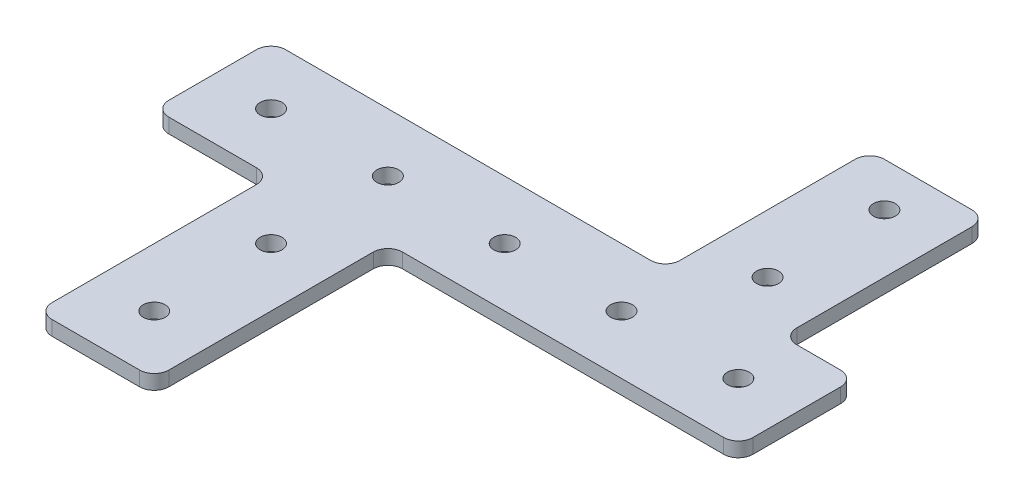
ISO-10303-21;
HEADER;
FILE_DESCRIPTION(('STEP AP214'),'2;1');
FILE_NAME('part.step','',(''),(''),'','','');
FILE_SCHEMA(('AUTOMOTIVE_DESIGN { 1 0 10303 214 1 1 1 1 }'));
ENDSEC;
DATA;
#1=APPLICATION_CONTEXT('core data for automotive mechanical design processes');
#2=APPLICATION_PROTOCOL_DEFINITION('international standard','automotive_design',2000,#1);
#3=PRODUCT_CONTEXT('',#1,'mechanical');
#4=PRODUCT('Part','Part','',(#3));
#5=PRODUCT_RELATED_PRODUCT_CATEGORY('part','',(#4));
#6=PRODUCT_DEFINITION_FORMATION('','',#4);
#7=PRODUCT_DEFINITION_CONTEXT('part definition',#1,'design');
#8=PRODUCT_DEFINITION('design','',#6,#7);
#9=PRODUCT_DEFINITION_SHAPE('','',#8);
#10=(LENGTH_UNIT() NAMED_UNIT(*) SI_UNIT(.MILLI.,.METRE.));
#11=(NAMED_UNIT(*) PLANE_ANGLE_UNIT() SI_UNIT($,.RADIAN.));
#12=(NAMED_UNIT(*) SI_UNIT($,.STERADIAN.) SOLID_ANGLE_UNIT());
#13=UNCERTAINTY_MEASURE_WITH_UNIT(LENGTH_MEASURE(1.E-05),#10,'distance_accuracy_value','');
#14=(GEOMETRIC_REPRESENTATION_CONTEXT(3) GLOBAL_UNCERTAINTY_ASSIGNED_CONTEXT((#13)) GLOBAL_UNIT_ASSIGNED_CONTEXT((#10,
#11,#12)) REPRESENTATION_CONTEXT('',''));
#15=CARTESIAN_POINT('',(0.,0.,0.));
#16=DIRECTION('',(0.,0.,1.));
#17=DIRECTION('',(1.,0.,0.));
#18=AXIS2_PLACEMENT_3D('',#15,#16,#17);
#19=CARTESIAN_POINT('',(0.,3.175,0.));
#20=DIRECTION('',(0.,1.,0.));
#21=DIRECTION('',(0.,0.,1.));
#22=AXIS2_PLACEMENT_3D('',#19,#20,#21);
#23=PLANE('',#22);
#24=CARTESIAN_POINT('',(-47.625,3.175,82.55));
#25=DIRECTION('',(0.,1.,0.));
#26=DIRECTION('',(0.,0.,1.));
#27=AXIS2_PLACEMENT_3D('',#24,#25,#26);
#28=CIRCLE('',#27,2.38125);
#29=CARTESIAN_POINT('',(-47.625,3.175,84.93125));
#30=VERTEX_POINT('',#29);
#31=EDGE_CURVE('E802',#30,#30,#28,.T.);
#32=ORIENTED_EDGE('',*,*,#31,.F.);
#33=EDGE_LOOP('',(#32));
#34=FACE_BOUND('',#33,.T.);
#35=CARTESIAN_POINT('',(-73.025,3.175,57.15));
#36=DIRECTION('',(0.,1.,0.));
#37=DIRECTION('',(0.,0.,1.));
#38=AXIS2_PLACEMENT_3D('',#35,#36,#37);
#39=CIRCLE('',#38,2.38125);
#40=CARTESIAN_POINT('',(-73.025,3.175,59.53125));
#41=VERTEX_POINT('',#40);
#42=EDGE_CURVE('E790',#41,#41,#39,.T.);
#43=ORIENTED_EDGE('',*,*,#42,.F.);
#44=EDGE_LOOP('',(#43));
#45=FACE_BOUND('',#44,.T.);
#46=CARTESIAN_POINT('',(12.7,3.175,9.52499999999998));
#47=DIRECTION('',(0.,1.,0.));
#48=DIRECTION('',(0.,0.,1.));
#49=AXIS2_PLACEMENT_3D('',#46,#47,#48);
#50=CIRCLE('',#49,2.38125);
#51=CARTESIAN_POINT('',(12.7,3.175,11.90625));
#52=VERTEX_POINT('',#51);
#53=EDGE_CURVE('E778',#52,#52,#50,.T.);
#54=ORIENTED_EDGE('',*,*,#53,.F.);
#55=EDGE_LOOP('',(#54));
#56=FACE_BOUND('',#55,.T.);
#57=CARTESIAN_POINT('',(3.175,3.175,57.15));
#58=DIRECTION('',(0.,1.,0.));
#59=DIRECTION('',(0.,0.,1.));
#60=AXIS2_PLACEMENT_3D('',#57,#58,#59);
#61=CIRCLE('',#60,2.38125);
#62=CARTESIAN_POINT('',(3.175,3.175,59.53125));
#63=VERTEX_POINT('',#62);
#64=EDGE_CURVE('E766',#63,#63,#61,.T.);
#65=ORIENTED_EDGE('',*,*,#64,.F.);
#66=EDGE_LOOP('',(#65));
#67=FACE_BOUND('',#66,.T.);
#68=DIRECTION('',(1.,0.,0.));
#69=VECTOR('',#68,1.);
#70=CARTESIAN_POINT('',(41.275,3.175,69.85));
#71=LINE('',#70,#69);
#72=CARTESIAN_POINT('',(-31.75,3.175,69.85));
#73=VERTEX_POINT('',#72);
#74=CARTESIAN_POINT('',(38.1,3.175,69.85));
#75=VERTEX_POINT('',#74);
#76=EDGE_CURVE('E217',#73,#75,#71,.T.);
#77=ORIENTED_EDGE('',*,*,#76,.T.);
#78=CARTESIAN_POINT('',(38.1,3.175,66.675));
#79=DIRECTION('',(0.,1.,0.));
#80=DIRECTION('',(0.,0.,1.));
#81=AXIS2_PLACEMENT_3D('',#78,#79,#80);
#82=CIRCLE('',#81,3.175);
#83=CARTESIAN_POINT('',(41.275,3.175,66.675));
#84=VERTEX_POINT('',#83);
#85=EDGE_CURVE('E284',#75,#84,#82,.T.);
#86=ORIENTED_EDGE('',*,*,#85,.T.);
#87=DIRECTION('',(0.,0.,-1.));
#88=VECTOR('',#87,1.);
#89=CARTESIAN_POINT('',(41.275,3.175,44.45));
#90=LINE('',#89,#88);
#91=CARTESIAN_POINT('',(41.275,3.175,47.625));
#92=VERTEX_POINT('',#91);
#93=EDGE_CURVE('E374',#84,#92,#90,.T.);
#94=ORIENTED_EDGE('',*,*,#93,.T.);
#95=CARTESIAN_POINT('',(38.1,3.175,47.625));
#96=DIRECTION('',(0.,1.,0.));
#97=DIRECTION('',(0.,0.,1.));
#98=AXIS2_PLACEMENT_3D('',#95,#96,#97);
#99=CIRCLE('',#98,3.175);
#100=CARTESIAN_POINT('',(38.1,3.175,44.45));
#101=VERTEX_POINT('',#100);
#102=EDGE_CURVE('E274',#92,#101,#99,.T.);
#103=ORIENTED_EDGE('',*,*,#102,.T.);
#104=DIRECTION('',(-1.,0.,0.));
#105=VECTOR('',#104,1.);
#106=CARTESIAN_POINT('',(25.4,3.175,44.45));
#107=LINE('',#106,#105);
#108=CARTESIAN_POINT('',(28.575,3.175,44.45));
#109=VERTEX_POINT('',#108);
#110=EDGE_CURVE('E377',#101,#109,#107,.T.);
#111=ORIENTED_EDGE('',*,*,#110,.T.);
#112=CARTESIAN_POINT('',(28.575,3.175,41.275));
#113=DIRECTION('',(0.,1.,0.));
#114=DIRECTION('',(0.,0.,1.));
#115=AXIS2_PLACEMENT_3D('',#112,#113,#114);
#116=CIRCLE('',#115,3.175);
#117=CARTESIAN_POINT('',(25.4,3.175,41.275));
#118=VERTEX_POINT('',#117);
#119=EDGE_CURVE('E336',#109,#118,#116,.F.);
#120=ORIENTED_EDGE('',*,*,#119,.T.);
#121=DIRECTION('',(0.,0.,-1.));
#122=VECTOR('',#121,1.);
#123=CARTESIAN_POINT('',(25.4,3.175,0.));
#124=LINE('',#123,#122);
#125=CARTESIAN_POINT('',(25.4,3.175,3.175));
#126=VERTEX_POINT('',#125);
#127=EDGE_CURVE('E380',#118,#126,#124,.T.);
#128=ORIENTED_EDGE('',*,*,#127,.T.);
#129=CARTESIAN_POINT('',(22.225,3.175,3.175));
#130=DIRECTION('',(0.,1.,0.));
#131=DIRECTION('',(0.,0.,1.));
#132=AXIS2_PLACEMENT_3D('',#129,#130,#131);
#133=CIRCLE('',#132,3.175);
#134=CARTESIAN_POINT('',(22.225,3.175,0.));
#135=VERTEX_POINT('',#134);
#136=EDGE_CURVE('E272',#126,#135,#133,.T.);
#137=ORIENTED_EDGE('',*,*,#136,.T.);
#138=DIRECTION('',(-1.,0.,0.));
#139=VECTOR('',#138,1.);
#140=CARTESIAN_POINT('',(0.,3.175,0.));
#141=LINE('',#140,#139);
#142=CARTESIAN_POINT('',(3.175,3.175,0.));
#143=VERTEX_POINT('',#142);
#144=EDGE_CURVE('E383',#135,#143,#141,.T.);
#145=ORIENTED_EDGE('',*,*,#144,.T.);
#146=CARTESIAN_POINT('',(3.175,3.175,3.175));
#147=DIRECTION('',(0.,1.,0.));
#148=DIRECTION('',(0.,0.,1.));
#149=AXIS2_PLACEMENT_3D('',#146,#147,#148);
#150=CIRCLE('',#149,3.175);
#151=CARTESIAN_POINT('',(0.,3.175,3.175));
#152=VERTEX_POINT('',#151);
#153=EDGE_CURVE('E57',#143,#152,#150,.T.);
#154=ORIENTED_EDGE('',*,*,#153,.T.);
#155=DIRECTION('',(0.,0.,1.));
#156=VECTOR('',#155,1.);
#157=CARTESIAN_POINT('',(0.,3.175,44.45));
#158=LINE('',#157,#156);
#159=CARTESIAN_POINT('',(0.,3.175,41.275));
#160=VERTEX_POINT('',#159);
#161=EDGE_CURVE('E246',#152,#160,#158,.T.);
#162=ORIENTED_EDGE('',*,*,#161,.T.);
#163=CARTESIAN_POINT('',(-3.175,3.175,41.275));
#164=DIRECTION('',(0.,1.,0.));
#165=DIRECTION('',(0.,0.,1.));
#166=AXIS2_PLACEMENT_3D('',#163,#164,#165);
#167=CIRCLE('',#166,3.175);
#168=CARTESIAN_POINT('',(-3.175,3.175,44.45));
#169=VERTEX_POINT('',#168);
#170=EDGE_CURVE('E11',#160,#169,#167,.F.);
#171=ORIENTED_EDGE('',*,*,#170,.T.);
#172=DIRECTION('',(-1.,0.,0.));
#173=VECTOR('',#172,1.);
#174=CARTESIAN_POINT('',(-34.925,3.175,44.45));
#175=LINE('',#174,#173);
#176=CARTESIAN_POINT('',(-82.55,3.175,44.45));
#177=VERTEX_POINT('',#176);
#178=EDGE_CURVE('E245',#169,#177,#175,.T.);
#179=ORIENTED_EDGE('',*,*,#178,.T.);
#180=CARTESIAN_POINT('',(-82.55,3.175,47.625));
#181=DIRECTION('',(0.,1.,0.));
#182=DIRECTION('',(0.,0.,1.));
#183=AXIS2_PLACEMENT_3D('',#180,#181,#182);
#184=CIRCLE('',#183,3.175);
#185=CARTESIAN_POINT('',(-85.725,3.175,47.625));
#186=VERTEX_POINT('',#185);
#187=EDGE_CURVE('E276',#177,#186,#184,.T.);
#188=ORIENTED_EDGE('',*,*,#187,.T.);
#189=DIRECTION('',(0.,0.,1.));
#190=VECTOR('',#189,1.);
#191=CARTESIAN_POINT('',(-85.725,3.175,44.45));
#192=LINE('',#191,#190);
#193=CARTESIAN_POINT('',(-85.725,3.175,66.675));
#194=VERTEX_POINT('',#193);
#195=EDGE_CURVE('E353',#186,#194,#192,.T.);
#196=ORIENTED_EDGE('',*,*,#195,.T.);
#197=CARTESIAN_POINT('',(-82.55,3.175,66.675));
#198=DIRECTION('',(0.,1.,0.));
#199=DIRECTION('',(0.,0.,1.));
#200=AXIS2_PLACEMENT_3D('',#197,#198,#199);
#201=CIRCLE('',#200,3.175);
#202=CARTESIAN_POINT('',(-82.55,3.175,69.85));
#203=VERTEX_POINT('',#202);
#204=EDGE_CURVE('E278',#194,#203,#201,.T.);
#205=ORIENTED_EDGE('',*,*,#204,.T.);
#206=DIRECTION('',(1.,0.,0.));
#207=VECTOR('',#206,1.);
#208=CARTESIAN_POINT('',(-85.725,3.175,69.85));
#209=LINE('',#208,#207);
#210=CARTESIAN_POINT('',(-63.5,3.175,69.85));
#211=VERTEX_POINT('',#210);
#212=EDGE_CURVE('E356',#203,#211,#209,.T.);
#213=ORIENTED_EDGE('',*,*,#212,.T.);
#214=CARTESIAN_POINT('',(-63.5,3.175,73.025));
#215=DIRECTION('',(0.,1.,0.));
#216=DIRECTION('',(0.,0.,1.));
#217=AXIS2_PLACEMENT_3D('',#214,#215,#216);
#218=CIRCLE('',#217,3.175);
#219=CARTESIAN_POINT('',(-60.325,3.175,73.025));
#220=VERTEX_POINT('',#219);
#221=EDGE_CURVE('E332',#211,#220,#218,.F.);
#222=ORIENTED_EDGE('',*,*,#221,.T.);
#223=DIRECTION('',(0.,0.,1.));
#224=VECTOR('',#223,1.);
#225=CARTESIAN_POINT('',(-60.325,3.175,69.85));
#226=LINE('',#225,#224);
#227=CARTESIAN_POINT('',(-60.325,3.175,117.475));
#228=VERTEX_POINT('',#227);
#229=EDGE_CURVE('E364',#220,#228,#226,.T.);
#230=ORIENTED_EDGE('',*,*,#229,.T.);
#231=CARTESIAN_POINT('',(-57.15,3.175,117.475));
#232=DIRECTION('',(0.,1.,0.));
#233=DIRECTION('',(0.,0.,1.));
#234=AXIS2_PLACEMENT_3D('',#231,#232,#233);
#235=CIRCLE('',#234,3.175);
#236=CARTESIAN_POINT('',(-57.15,3.175,120.65));
#237=VERTEX_POINT('',#236);
#238=EDGE_CURVE('E280',#228,#237,#235,.T.);
#239=ORIENTED_EDGE('',*,*,#238,.T.);
#240=DIRECTION('',(1.,0.,0.));
#241=VECTOR('',#240,1.);
#242=CARTESIAN_POINT('',(-60.325,3.175,120.65));
#243=LINE('',#242,#241);
#244=CARTESIAN_POINT('',(-38.1,3.175,120.65));
#245=VERTEX_POINT('',#244);
#246=EDGE_CURVE('E367',#237,#245,#243,.T.);
#247=ORIENTED_EDGE('',*,*,#246,.T.);
#248=CARTESIAN_POINT('',(-38.1,3.175,117.475));
#249=DIRECTION('',(0.,1.,0.));
#250=DIRECTION('',(0.,0.,1.));
#251=AXIS2_PLACEMENT_3D('',#248,#249,#250);
#252=CIRCLE('',#251,3.175);
#253=CARTESIAN_POINT('',(-34.925,3.175,117.475));
#254=VERTEX_POINT('',#253);
#255=EDGE_CURVE('E282',#245,#254,#252,.T.);
#256=ORIENTED_EDGE('',*,*,#255,.T.);
#257=DIRECTION('',(0.,0.,-1.));
#258=VECTOR('',#257,1.);
#259=CARTESIAN_POINT('',(-34.925,3.175,120.65));
#260=LINE('',#259,#258);
#261=CARTESIAN_POINT('',(-34.925,3.175,73.025));
#262=VERTEX_POINT('',#261);
#263=EDGE_CURVE('E370',#254,#262,#260,.T.);
#264=ORIENTED_EDGE('',*,*,#263,.T.);
#265=CARTESIAN_POINT('',(-31.75,3.175,73.025));
#266=DIRECTION('',(0.,1.,0.));
#267=DIRECTION('',(0.,0.,1.));
#268=AXIS2_PLACEMENT_3D('',#265,#266,#267);
#269=CIRCLE('',#268,3.175);
#270=EDGE_CURVE('E207',#262,#73,#269,.F.);
#271=ORIENTED_EDGE('',*,*,#270,.T.);
#272=EDGE_LOOP('',(#77,#86,#94,#103,#111,#120,#128,#137,#145,#154,#162,#171,#179,#188,#196,#205,
#213,#222,#230,#239,#247,#256,#264,#271));
#273=FACE_BOUND('',#272,.T.);
#274=CARTESIAN_POINT('',(-22.225,3.175,57.15));
#275=DIRECTION('',(0.,1.,0.));
#276=DIRECTION('',(0.,0.,1.));
#277=AXIS2_PLACEMENT_3D('',#274,#275,#276);
#278=CIRCLE('',#277,2.38125);
#279=CARTESIAN_POINT('',(-22.225,3.175,59.53125));
#280=VERTEX_POINT('',#279);
#281=EDGE_CURVE('E388',#280,#280,#278,.T.);
#282=ORIENTED_EDGE('',*,*,#281,.F.);
#283=EDGE_LOOP('',(#282));
#284=FACE_BOUND('',#283,.T.);
#285=CARTESIAN_POINT('',(28.575,3.175,57.15));
#286=DIRECTION('',(0.,1.,0.));
#287=DIRECTION('',(0.,0.,1.));
#288=AXIS2_PLACEMENT_3D('',#285,#286,#287);
#289=CIRCLE('',#288,2.38125);
#290=CARTESIAN_POINT('',(28.575,3.175,59.53125));
#291=VERTEX_POINT('',#290);
#292=EDGE_CURVE('E772',#291,#291,#289,.T.);
#293=ORIENTED_EDGE('',*,*,#292,.F.);
#294=EDGE_LOOP('',(#293));
#295=FACE_BOUND('',#294,.T.);
#296=CARTESIAN_POINT('',(12.7,3.175,34.925));
#297=DIRECTION('',(0.,1.,0.));
#298=DIRECTION('',(0.,0.,1.));
#299=AXIS2_PLACEMENT_3D('',#296,#297,#298);
#300=CIRCLE('',#299,2.38125);
#301=CARTESIAN_POINT('',(12.7,3.175,37.30625));
#302=VERTEX_POINT('',#301);
#303=EDGE_CURVE('E784',#302,#302,#300,.T.);
#304=ORIENTED_EDGE('',*,*,#303,.F.);
#305=EDGE_LOOP('',(#304));
#306=FACE_BOUND('',#305,.T.);
#307=CARTESIAN_POINT('',(-47.625,3.175,57.15));
#308=DIRECTION('',(0.,1.,0.));
#309=DIRECTION('',(0.,0.,1.));
#310=AXIS2_PLACEMENT_3D('',#307,#308,#309);
#311=CIRCLE('',#310,2.38125);
#312=CARTESIAN_POINT('',(-47.625,3.175,59.53125));
#313=VERTEX_POINT('',#312);
#314=EDGE_CURVE('E796',#313,#313,#311,.T.);
#315=ORIENTED_EDGE('',*,*,#314,.F.);
#316=EDGE_LOOP('',(#315));
#317=FACE_BOUND('',#316,.T.);
#318=CARTESIAN_POINT('',(-47.625,3.175,107.95));
#319=DIRECTION('',(0.,1.,0.));
#320=DIRECTION('',(0.,0.,1.));
#321=AXIS2_PLACEMENT_3D('',#318,#319,#320);
#322=CIRCLE('',#321,2.38125);
#323=CARTESIAN_POINT('',(-47.625,3.175,110.33125));
#324=VERTEX_POINT('',#323);
#325=EDGE_CURVE('E808',#324,#324,#322,.T.);
#326=ORIENTED_EDGE('',*,*,#325,.F.);
#327=EDGE_LOOP('',(#326));
#328=FACE_BOUND('',#327,.T.);
#329=ADVANCED_FACE('F35',(#34,#45,#56,#67,#273,#284,#295,#306,#317,#328),#23,.T.);
#330=CARTESIAN_POINT('',(0.,0.,0.));
#331=DIRECTION('',(0.,1.,0.));
#332=DIRECTION('',(0.,0.,1.));
#333=AXIS2_PLACEMENT_3D('',#330,#331,#332);
#334=PLANE('',#333);
#335=DIRECTION('',(0.,0.,-1.));
#336=VECTOR('',#335,1.);
#337=CARTESIAN_POINT('',(41.275,0.,44.45));
#338=LINE('',#337,#336);
#339=CARTESIAN_POINT('',(41.275,0.,66.675));
#340=VERTEX_POINT('',#339);
#341=CARTESIAN_POINT('',(41.275,0.,47.625));
#342=VERTEX_POINT('',#341);
#343=EDGE_CURVE('E225',#340,#342,#338,.T.);
#344=ORIENTED_EDGE('',*,*,#343,.F.);
#345=CARTESIAN_POINT('',(38.1,0.,66.675));
#346=DIRECTION('',(0.,1.,0.));
#347=DIRECTION('',(0.,0.,1.));
#348=AXIS2_PLACEMENT_3D('',#345,#346,#347);
#349=CIRCLE('',#348,3.175);
#350=CARTESIAN_POINT('',(38.1,0.,69.85));
#351=VERTEX_POINT('',#350);
#352=EDGE_CURVE('E224',#340,#351,#349,.F.);
#353=ORIENTED_EDGE('',*,*,#352,.T.);
#354=DIRECTION('',(1.,0.,0.));
#355=VECTOR('',#354,1.);
#356=CARTESIAN_POINT('',(41.275,0.,69.85));
#357=LINE('',#356,#355);
#358=CARTESIAN_POINT('',(-31.75,0.,69.85));
#359=VERTEX_POINT('',#358);
#360=EDGE_CURVE('E214',#359,#351,#357,.T.);
#361=ORIENTED_EDGE('',*,*,#360,.F.);
#362=CARTESIAN_POINT('',(-31.75,0.,73.025));
#363=DIRECTION('',(0.,1.,0.));
#364=DIRECTION('',(0.,0.,1.));
#365=AXIS2_PLACEMENT_3D('',#362,#363,#364);
#366=CIRCLE('',#365,3.175);
#367=CARTESIAN_POINT('',(-34.925,0.,73.025));
#368=VERTEX_POINT('',#367);
#369=EDGE_CURVE('E197',#359,#368,#366,.T.);
#370=ORIENTED_EDGE('',*,*,#369,.T.);
#371=DIRECTION('',(0.,0.,-1.));
#372=VECTOR('',#371,1.);
#373=CARTESIAN_POINT('',(-34.925,0.,120.65));
#374=LINE('',#373,#372);
#375=CARTESIAN_POINT('',(-34.925,0.,117.475));
#376=VERTEX_POINT('',#375);
#377=EDGE_CURVE('E226',#376,#368,#374,.T.);
#378=ORIENTED_EDGE('',*,*,#377,.F.);
#379=CARTESIAN_POINT('',(-38.1,0.,117.475));
#380=DIRECTION('',(0.,1.,0.));
#381=DIRECTION('',(0.,0.,1.));
#382=AXIS2_PLACEMENT_3D('',#379,#380,#381);
#383=CIRCLE('',#382,3.175);
#384=CARTESIAN_POINT('',(-38.1,0.,120.65));
#385=VERTEX_POINT('',#384);
#386=EDGE_CURVE('E268',#376,#385,#383,.F.);
#387=ORIENTED_EDGE('',*,*,#386,.T.);
#388=DIRECTION('',(1.,0.,0.));
#389=VECTOR('',#388,1.);
#390=CARTESIAN_POINT('',(-60.325,0.,120.65));
#391=LINE('',#390,#389);
#392=CARTESIAN_POINT('',(-57.15,0.,120.65));
#393=VERTEX_POINT('',#392);
#394=EDGE_CURVE('E231',#393,#385,#391,.T.);
#395=ORIENTED_EDGE('',*,*,#394,.F.);
#396=CARTESIAN_POINT('',(-57.15,0.,117.475));
#397=DIRECTION('',(0.,1.,0.));
#398=DIRECTION('',(0.,0.,1.));
#399=AXIS2_PLACEMENT_3D('',#396,#397,#398);
#400=CIRCLE('',#399,3.175);
#401=CARTESIAN_POINT('',(-60.325,0.,117.475));
#402=VERTEX_POINT('',#401);
#403=EDGE_CURVE('E266',#393,#402,#400,.F.);
#404=ORIENTED_EDGE('',*,*,#403,.T.);
#405=DIRECTION('',(0.,0.,1.));
#406=VECTOR('',#405,1.);
#407=CARTESIAN_POINT('',(-60.325,0.,69.85));
#408=LINE('',#407,#406);
#409=CARTESIAN_POINT('',(-60.325,0.,73.025));
#410=VERTEX_POINT('',#409);
#411=EDGE_CURVE('E394',#410,#402,#408,.T.);
#412=ORIENTED_EDGE('',*,*,#411,.F.);
#413=CARTESIAN_POINT('',(-63.5,0.,73.025));
#414=DIRECTION('',(0.,1.,0.));
#415=DIRECTION('',(0.,0.,1.));
#416=AXIS2_PLACEMENT_3D('',#413,#414,#415);
#417=CIRCLE('',#416,3.175);
#418=CARTESIAN_POINT('',(-63.5,0.,69.85));
#419=VERTEX_POINT('',#418);
#420=EDGE_CURVE('E330',#410,#419,#417,.T.);
#421=ORIENTED_EDGE('',*,*,#420,.T.);
#422=DIRECTION('',(1.,0.,0.));
#423=VECTOR('',#422,1.);
#424=CARTESIAN_POINT('',(-85.725,0.,69.85));
#425=LINE('',#424,#423);
#426=CARTESIAN_POINT('',(-82.55,0.,69.85));
#427=VERTEX_POINT('',#426);
#428=EDGE_CURVE('E391',#427,#419,#425,.T.);
#429=ORIENTED_EDGE('',*,*,#428,.F.);
#430=CARTESIAN_POINT('',(-82.55,0.,66.675));
#431=DIRECTION('',(0.,1.,0.));
#432=DIRECTION('',(0.,0.,1.));
#433=AXIS2_PLACEMENT_3D('',#430,#431,#432);
#434=CIRCLE('',#433,3.175);
#435=CARTESIAN_POINT('',(-85.725,0.,66.675));
#436=VERTEX_POINT('',#435);
#437=EDGE_CURVE('E264',#427,#436,#434,.F.);
#438=ORIENTED_EDGE('',*,*,#437,.T.);
#439=DIRECTION('',(0.,0.,1.));
#440=VECTOR('',#439,1.);
#441=CARTESIAN_POINT('',(-85.725,0.,44.45));
#442=LINE('',#441,#440);
#443=CARTESIAN_POINT('',(-85.725,0.,47.625));
#444=VERTEX_POINT('',#443);
#445=EDGE_CURVE('E387',#444,#436,#442,.T.);
#446=ORIENTED_EDGE('',*,*,#445,.F.);
#447=CARTESIAN_POINT('',(-82.55,0.,47.625));
#448=DIRECTION('',(0.,1.,0.));
#449=DIRECTION('',(0.,0.,1.));
#450=AXIS2_PLACEMENT_3D('',#447,#448,#449);
#451=CIRCLE('',#450,3.175);
#452=CARTESIAN_POINT('',(-82.55,0.,44.45));
#453=VERTEX_POINT('',#452);
#454=EDGE_CURVE('E262',#444,#453,#451,.F.);
#455=ORIENTED_EDGE('',*,*,#454,.T.);
#456=DIRECTION('',(-1.,0.,0.));
#457=VECTOR('',#456,1.);
#458=CARTESIAN_POINT('',(-34.925,0.,44.45));
#459=LINE('',#458,#457);
#460=CARTESIAN_POINT('',(-3.175,0.,44.45));
#461=VERTEX_POINT('',#460);
#462=EDGE_CURVE('E340',#461,#453,#459,.T.);
#463=ORIENTED_EDGE('',*,*,#462,.F.);
#464=CARTESIAN_POINT('',(-3.175,0.,41.275));
#465=DIRECTION('',(0.,1.,0.));
#466=DIRECTION('',(0.,0.,1.));
#467=AXIS2_PLACEMENT_3D('',#464,#465,#466);
#468=CIRCLE('',#467,3.175);
#469=CARTESIAN_POINT('',(0.,0.,41.275));
#470=VERTEX_POINT('',#469);
#471=EDGE_CURVE('E43',#461,#470,#468,.T.);
#472=ORIENTED_EDGE('',*,*,#471,.T.);
#473=DIRECTION('',(0.,0.,1.));
#474=VECTOR('',#473,1.);
#475=CARTESIAN_POINT('',(0.,0.,44.45));
#476=LINE('',#475,#474);
#477=CARTESIAN_POINT('',(0.,0.,3.175));
#478=VERTEX_POINT('',#477);
#479=EDGE_CURVE('E243',#478,#470,#476,.T.);
#480=ORIENTED_EDGE('',*,*,#479,.F.);
#481=CARTESIAN_POINT('',(3.175,0.,3.175));
#482=DIRECTION('',(0.,1.,0.));
#483=DIRECTION('',(0.,0.,1.));
#484=AXIS2_PLACEMENT_3D('',#481,#482,#483);
#485=CIRCLE('',#484,3.175);
#486=CARTESIAN_POINT('',(3.175,0.,0.));
#487=VERTEX_POINT('',#486);
#488=EDGE_CURVE('E256',#478,#487,#485,.F.);
#489=ORIENTED_EDGE('',*,*,#488,.T.);
#490=DIRECTION('',(-1.,0.,0.));
#491=VECTOR('',#490,1.);
#492=CARTESIAN_POINT('',(0.,0.,0.));
#493=LINE('',#492,#491);
#494=CARTESIAN_POINT('',(22.225,0.,0.));
#495=VERTEX_POINT('',#494);
#496=EDGE_CURVE('E240',#495,#487,#493,.T.);
#497=ORIENTED_EDGE('',*,*,#496,.F.);
#498=CARTESIAN_POINT('',(22.225,0.,3.175));
#499=DIRECTION('',(0.,1.,0.));
#500=DIRECTION('',(0.,0.,1.));
#501=AXIS2_PLACEMENT_3D('',#498,#499,#500);
#502=CIRCLE('',#501,3.175);
#503=CARTESIAN_POINT('',(25.4,0.,3.175));
#504=VERTEX_POINT('',#503);
#505=EDGE_CURVE('E258',#495,#504,#502,.F.);
#506=ORIENTED_EDGE('',*,*,#505,.T.);
#507=DIRECTION('',(0.,0.,-1.));
#508=VECTOR('',#507,1.);
#509=CARTESIAN_POINT('',(25.4,0.,0.));
#510=LINE('',#509,#508);
#511=CARTESIAN_POINT('',(25.4,0.,41.275));
#512=VERTEX_POINT('',#511);
#513=EDGE_CURVE('E237',#512,#504,#510,.T.);
#514=ORIENTED_EDGE('',*,*,#513,.F.);
#515=CARTESIAN_POINT('',(28.575,0.,41.275));
#516=DIRECTION('',(0.,1.,0.));
#517=DIRECTION('',(0.,0.,1.));
#518=AXIS2_PLACEMENT_3D('',#515,#516,#517);
#519=CIRCLE('',#518,3.175);
#520=CARTESIAN_POINT('',(28.575,0.,44.45));
#521=VERTEX_POINT('',#520);
#522=EDGE_CURVE('E334',#512,#521,#519,.T.);
#523=ORIENTED_EDGE('',*,*,#522,.T.);
#524=DIRECTION('',(-1.,0.,0.));
#525=VECTOR('',#524,1.);
#526=CARTESIAN_POINT('',(25.4,0.,44.45));
#527=LINE('',#526,#525);
#528=CARTESIAN_POINT('',(38.1,0.,44.45));
#529=VERTEX_POINT('',#528);
#530=EDGE_CURVE('E229',#529,#521,#527,.T.);
#531=ORIENTED_EDGE('',*,*,#530,.F.);
#532=CARTESIAN_POINT('',(38.1,0.,47.625));
#533=DIRECTION('',(0.,1.,0.));
#534=DIRECTION('',(0.,0.,1.));
#535=AXIS2_PLACEMENT_3D('',#532,#533,#534);
#536=CIRCLE('',#535,3.175);
#537=EDGE_CURVE('E260',#529,#342,#536,.F.);
#538=ORIENTED_EDGE('',*,*,#537,.T.);
#539=EDGE_LOOP('',(#344,#353,#361,#370,#378,#387,#395,#404,#412,#421,#429,#438,#446,#455,#463,
#472,#480,#489,#497,#506,#514,#523,#531,#538));
#540=FACE_BOUND('',#539,.T.);
#541=CARTESIAN_POINT('',(-22.225,0.,57.15));
#542=DIRECTION('',(0.,1.,0.));
#543=DIRECTION('',(0.,0.,1.));
#544=AXIS2_PLACEMENT_3D('',#541,#542,#543);
#545=CIRCLE('',#544,2.38125);
#546=CARTESIAN_POINT('',(-22.225,0.,59.53125));
#547=VERTEX_POINT('',#546);
#548=EDGE_CURVE('E359',#547,#547,#545,.T.);
#549=ORIENTED_EDGE('',*,*,#548,.T.);
#550=EDGE_LOOP('',(#549));
#551=FACE_BOUND('',#550,.T.);
#552=CARTESIAN_POINT('',(3.175,0.,57.15));
#553=DIRECTION('',(0.,1.,0.));
#554=DIRECTION('',(0.,0.,1.));
#555=AXIS2_PLACEMENT_3D('',#552,#553,#554);
#556=CIRCLE('',#555,2.38125);
#557=CARTESIAN_POINT('',(3.175,0.,59.53125));
#558=VERTEX_POINT('',#557);
#559=EDGE_CURVE('E768',#558,#558,#556,.T.);
#560=ORIENTED_EDGE('',*,*,#559,.T.);
#561=EDGE_LOOP('',(#560));
#562=FACE_BOUND('',#561,.T.);
#563=CARTESIAN_POINT('',(28.575,0.,57.15));
#564=DIRECTION('',(0.,1.,0.));
#565=DIRECTION('',(0.,0.,1.));
#566=AXIS2_PLACEMENT_3D('',#563,#564,#565);
#567=CIRCLE('',#566,2.38125);
#568=CARTESIAN_POINT('',(28.575,0.,59.53125));
#569=VERTEX_POINT('',#568);
#570=EDGE_CURVE('E775',#569,#569,#567,.T.);
#571=ORIENTED_EDGE('',*,*,#570,.T.);
#572=EDGE_LOOP('',(#571));
#573=FACE_BOUND('',#572,.T.);
#574=CARTESIAN_POINT('',(12.7,0.,9.52499999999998));
#575=DIRECTION('',(0.,1.,0.));
#576=DIRECTION('',(0.,0.,1.));
#577=AXIS2_PLACEMENT_3D('',#574,#575,#576);
#578=CIRCLE('',#577,2.38125);
#579=CARTESIAN_POINT('',(12.7,0.,11.90625));
#580=VERTEX_POINT('',#579);
#581=EDGE_CURVE('E781',#580,#580,#578,.T.);
#582=ORIENTED_EDGE('',*,*,#581,.T.);
#583=EDGE_LOOP('',(#582));
#584=FACE_BOUND('',#583,.T.);
#585=CARTESIAN_POINT('',(12.7,0.,34.925));
#586=DIRECTION('',(0.,1.,0.));
#587=DIRECTION('',(0.,0.,1.));
#588=AXIS2_PLACEMENT_3D('',#585,#586,#587);
#589=CIRCLE('',#588,2.38125);
#590=CARTESIAN_POINT('',(12.7,0.,37.30625));
#591=VERTEX_POINT('',#590);
#592=EDGE_CURVE('E787',#591,#591,#589,.T.);
#593=ORIENTED_EDGE('',*,*,#592,.T.);
#594=EDGE_LOOP('',(#593));
#595=FACE_BOUND('',#594,.T.);
#596=CARTESIAN_POINT('',(-73.025,0.,57.15));
#597=DIRECTION('',(0.,1.,0.));
#598=DIRECTION('',(0.,0.,1.));
#599=AXIS2_PLACEMENT_3D('',#596,#597,#598);
#600=CIRCLE('',#599,2.38125);
#601=CARTESIAN_POINT('',(-73.025,0.,59.53125));
#602=VERTEX_POINT('',#601);
#603=EDGE_CURVE('E793',#602,#602,#600,.T.);
#604=ORIENTED_EDGE('',*,*,#603,.T.);
#605=EDGE_LOOP('',(#604));
#606=FACE_BOUND('',#605,.T.);
#607=CARTESIAN_POINT('',(-47.625,0.,57.15));
#608=DIRECTION('',(0.,1.,0.));
#609=DIRECTION('',(0.,0.,1.));
#610=AXIS2_PLACEMENT_3D('',#607,#608,#609);
#611=CIRCLE('',#610,2.38125);
#612=CARTESIAN_POINT('',(-47.625,0.,59.53125));
#613=VERTEX_POINT('',#612);
#614=EDGE_CURVE('E799',#613,#613,#611,.T.);
#615=ORIENTED_EDGE('',*,*,#614,.T.);
#616=EDGE_LOOP('',(#615));
#617=FACE_BOUND('',#616,.T.);
#618=CARTESIAN_POINT('',(-47.625,0.,82.55));
#619=DIRECTION('',(0.,1.,0.));
#620=DIRECTION('',(0.,0.,1.));
#621=AXIS2_PLACEMENT_3D('',#618,#619,#620);
#622=CIRCLE('',#621,2.38125);
#623=CARTESIAN_POINT('',(-47.625,0.,84.93125));
#624=VERTEX_POINT('',#623);
#625=EDGE_CURVE('E805',#624,#624,#622,.T.);
#626=ORIENTED_EDGE('',*,*,#625,.T.);
#627=EDGE_LOOP('',(#626));
#628=FACE_BOUND('',#627,.T.);
#629=CARTESIAN_POINT('',(-47.625,0.,107.95));
#630=DIRECTION('',(0.,1.,0.));
#631=DIRECTION('',(0.,0.,1.));
#632=AXIS2_PLACEMENT_3D('',#629,#630,#631);
#633=CIRCLE('',#632,2.38125);
#634=CARTESIAN_POINT('',(-47.625,0.,110.33125));
#635=VERTEX_POINT('',#634);
#636=EDGE_CURVE('E811',#635,#635,#633,.T.);
#637=ORIENTED_EDGE('',*,*,#636,.T.);
#638=EDGE_LOOP('',(#637));
#639=FACE_BOUND('',#638,.T.);
#640=ADVANCED_FACE('F222',(#540,#551,#562,#573,#584,#595,#606,#617,#628,#639),#334,.F.);
#641=CARTESIAN_POINT('',(-34.925,3.175,44.45));
#642=DIRECTION('',(0.,0.,1.));
#643=DIRECTION('',(1.,0.,0.));
#644=AXIS2_PLACEMENT_3D('',#641,#642,#643);
#645=PLANE('',#644);
#646=ORIENTED_EDGE('',*,*,#462,.T.);
#647=DIRECTION('',(0.,-1.,0.));
#648=VECTOR('',#647,1.);
#649=CARTESIAN_POINT('',(-82.55,3.175,44.45));
#650=LINE('',#649,#648);
#651=EDGE_CURVE('E309',#453,#177,#650,.F.);
#652=ORIENTED_EDGE('',*,*,#651,.T.);
#653=ORIENTED_EDGE('',*,*,#178,.F.);
#654=DIRECTION('',(0.,-1.,0.));
#655=VECTOR('',#654,1.);
#656=CARTESIAN_POINT('',(-3.175,0.,44.45));
#657=LINE('',#656,#655);
#658=EDGE_CURVE('E306',#169,#461,#657,.T.);
#659=ORIENTED_EDGE('',*,*,#658,.T.);
#660=EDGE_LOOP('',(#646,#652,#653,#659));
#661=FACE_BOUND('',#660,.T.);
#662=ADVANCED_FACE('F351',(#661),#645,.F.);
#663=CARTESIAN_POINT('',(-85.725,3.175,44.45));
#664=DIRECTION('',(1.,0.,0.));
#665=DIRECTION('',(0.,0.,-1.));
#666=AXIS2_PLACEMENT_3D('',#663,#664,#665);
#667=PLANE('',#666);
#668=ORIENTED_EDGE('',*,*,#445,.T.);
#669=DIRECTION('',(0.,-1.,0.));
#670=VECTOR('',#669,1.);
#671=CARTESIAN_POINT('',(-85.725,3.175,66.675));
#672=LINE('',#671,#670);
#673=EDGE_CURVE('E304',#436,#194,#672,.F.);
#674=ORIENTED_EDGE('',*,*,#673,.T.);
#675=ORIENTED_EDGE('',*,*,#195,.F.);
#676=DIRECTION('',(0.,-1.,0.));
#677=VECTOR('',#676,1.);
#678=CARTESIAN_POINT('',(-85.725,3.175,47.625));
#679=LINE('',#678,#677);
#680=EDGE_CURVE('E301',#186,#444,#679,.T.);
#681=ORIENTED_EDGE('',*,*,#680,.T.);
#682=EDGE_LOOP('',(#668,#674,#675,#681));
#683=FACE_BOUND('',#682,.T.);
#684=ADVANCED_FACE('F647',(#683),#667,.F.);
#685=CARTESIAN_POINT('',(-85.725,3.175,69.85));
#686=DIRECTION('',(0.,0.,-1.));
#687=DIRECTION('',(-1.,0.,0.));
#688=AXIS2_PLACEMENT_3D('',#685,#686,#687);
#689=PLANE('',#688);
#690=ORIENTED_EDGE('',*,*,#428,.T.);
#691=DIRECTION('',(0.,-1.,0.));
#692=VECTOR('',#691,1.);
#693=CARTESIAN_POINT('',(-63.5,3.175,69.85));
#694=LINE('',#693,#692);
#695=EDGE_CURVE('E299',#419,#211,#694,.F.);
#696=ORIENTED_EDGE('',*,*,#695,.T.);
#697=ORIENTED_EDGE('',*,*,#212,.F.);
#698=DIRECTION('',(0.,-1.,0.));
#699=VECTOR('',#698,1.);
#700=CARTESIAN_POINT('',(-82.55,3.175,69.85));
#701=LINE('',#700,#699);
#702=EDGE_CURVE('E296',#203,#427,#701,.T.);
#703=ORIENTED_EDGE('',*,*,#702,.T.);
#704=EDGE_LOOP('',(#690,#696,#697,#703));
#705=FACE_BOUND('',#704,.T.);
#706=ADVANCED_FACE('F637',(#705),#689,.F.);
#707=CARTESIAN_POINT('',(-60.325,3.175,69.85));
#708=DIRECTION('',(1.,0.,0.));
#709=DIRECTION('',(0.,0.,-1.));
#710=AXIS2_PLACEMENT_3D('',#707,#708,#709);
#711=PLANE('',#710);
#712=ORIENTED_EDGE('',*,*,#411,.T.);
#713=DIRECTION('',(0.,-1.,0.));
#714=VECTOR('',#713,1.);
#715=CARTESIAN_POINT('',(-60.325,3.175,117.475));
#716=LINE('',#715,#714);
#717=EDGE_CURVE('E294',#402,#228,#716,.F.);
#718=ORIENTED_EDGE('',*,*,#717,.T.);
#719=ORIENTED_EDGE('',*,*,#229,.F.);
#720=DIRECTION('',(0.,-1.,0.));
#721=VECTOR('',#720,1.);
#722=CARTESIAN_POINT('',(-60.325,0.,73.025));
#723=LINE('',#722,#721);
#724=EDGE_CURVE('E291',#220,#410,#723,.T.);
#725=ORIENTED_EDGE('',*,*,#724,.T.);
#726=EDGE_LOOP('',(#712,#718,#719,#725));
#727=FACE_BOUND('',#726,.T.);
#728=ADVANCED_FACE('F418',(#727),#711,.F.);
#729=CARTESIAN_POINT('',(-60.325,3.175,120.65));
#730=DIRECTION('',(0.,0.,-1.));
#731=DIRECTION('',(-1.,0.,0.));
#732=AXIS2_PLACEMENT_3D('',#729,#730,#731);
#733=PLANE('',#732);
#734=ORIENTED_EDGE('',*,*,#394,.T.);
#735=DIRECTION('',(0.,-1.,0.));
#736=VECTOR('',#735,1.);
#737=CARTESIAN_POINT('',(-38.1,3.175,120.65));
#738=LINE('',#737,#736);
#739=EDGE_CURVE('E289',#385,#245,#738,.F.);
#740=ORIENTED_EDGE('',*,*,#739,.T.);
#741=ORIENTED_EDGE('',*,*,#246,.F.);
#742=DIRECTION('',(0.,-1.,0.));
#743=VECTOR('',#742,1.);
#744=CARTESIAN_POINT('',(-57.15,3.175,120.65));
#745=LINE('',#744,#743);
#746=EDGE_CURVE('E286',#237,#393,#745,.T.);
#747=ORIENTED_EDGE('',*,*,#746,.T.);
#748=EDGE_LOOP('',(#734,#740,#741,#747));
#749=FACE_BOUND('',#748,.T.);
#750=ADVANCED_FACE('F400',(#749),#733,.F.);
#751=CARTESIAN_POINT('',(-34.925,3.175,120.65));
#752=DIRECTION('',(-1.,0.,0.));
#753=DIRECTION('',(0.,0.,1.));
#754=AXIS2_PLACEMENT_3D('',#751,#752,#753);
#755=PLANE('',#754);
#756=ORIENTED_EDGE('',*,*,#377,.T.);
#757=DIRECTION('',(0.,-1.,0.));
#758=VECTOR('',#757,1.);
#759=CARTESIAN_POINT('',(-34.925,3.175,73.025));
#760=LINE('',#759,#758);
#761=EDGE_CURVE('E202',#368,#262,#760,.F.);
#762=ORIENTED_EDGE('',*,*,#761,.T.);
#763=ORIENTED_EDGE('',*,*,#263,.F.);
#764=DIRECTION('',(0.,-1.,0.));
#765=VECTOR('',#764,1.);
#766=CARTESIAN_POINT('',(-34.925,3.175,117.475));
#767=LINE('',#766,#765);
#768=EDGE_CURVE('E218',#254,#376,#767,.T.);
#769=ORIENTED_EDGE('',*,*,#768,.T.);
#770=EDGE_LOOP('',(#756,#762,#763,#769));
#771=FACE_BOUND('',#770,.T.);
#772=ADVANCED_FACE('F409',(#771),#755,.F.);
#773=CARTESIAN_POINT('',(41.275,3.175,69.85));
#774=DIRECTION('',(0.,0.,-1.));
#775=DIRECTION('',(-1.,0.,0.));
#776=AXIS2_PLACEMENT_3D('',#773,#774,#775);
#777=PLANE('',#776);
#778=ORIENTED_EDGE('',*,*,#76,.F.);
#779=DIRECTION('',(0.,-1.,0.));
#780=VECTOR('',#779,1.);
#781=CARTESIAN_POINT('',(-31.75,0.,69.85));
#782=LINE('',#781,#780);
#783=EDGE_CURVE('E201',#73,#359,#782,.T.);
#784=ORIENTED_EDGE('',*,*,#783,.T.);
#785=ORIENTED_EDGE('',*,*,#360,.T.);
#786=DIRECTION('',(0.,-1.,0.));
#787=VECTOR('',#786,1.);
#788=CARTESIAN_POINT('',(38.1,3.175,69.85));
#789=LINE('',#788,#787);
#790=EDGE_CURVE('E219',#351,#75,#789,.F.);
#791=ORIENTED_EDGE('',*,*,#790,.T.);
#792=EDGE_LOOP('',(#778,#784,#785,#791));
#793=FACE_BOUND('',#792,.T.);
#794=ADVANCED_FACE('F213',(#793),#777,.F.);
#795=CARTESIAN_POINT('',(41.275,3.175,44.45));
#796=DIRECTION('',(-1.,0.,0.));
#797=DIRECTION('',(0.,0.,1.));
#798=AXIS2_PLACEMENT_3D('',#795,#796,#797);
#799=PLANE('',#798);
#800=ORIENTED_EDGE('',*,*,#93,.F.);
#801=DIRECTION('',(0.,-1.,0.));
#802=VECTOR('',#801,1.);
#803=CARTESIAN_POINT('',(41.275,3.175,66.675));
#804=LINE('',#803,#802);
#805=EDGE_CURVE('E253',#84,#340,#804,.T.);
#806=ORIENTED_EDGE('',*,*,#805,.T.);
#807=ORIENTED_EDGE('',*,*,#343,.T.);
#808=DIRECTION('',(0.,-1.,0.));
#809=VECTOR('',#808,1.);
#810=CARTESIAN_POINT('',(41.275,3.175,47.625));
#811=LINE('',#810,#809);
#812=EDGE_CURVE('E251',#342,#92,#811,.F.);
#813=ORIENTED_EDGE('',*,*,#812,.T.);
#814=EDGE_LOOP('',(#800,#806,#807,#813));
#815=FACE_BOUND('',#814,.T.);
#816=ADVANCED_FACE('F416',(#815),#799,.F.);
#817=CARTESIAN_POINT('',(25.4,3.175,44.45));
#818=DIRECTION('',(0.,0.,1.));
#819=DIRECTION('',(1.,0.,0.));
#820=AXIS2_PLACEMENT_3D('',#817,#818,#819);
#821=PLANE('',#820);
#822=ORIENTED_EDGE('',*,*,#110,.F.);
#823=DIRECTION('',(0.,-1.,0.));
#824=VECTOR('',#823,1.);
#825=CARTESIAN_POINT('',(38.1,3.175,44.45));
#826=LINE('',#825,#824);
#827=EDGE_CURVE('E313',#101,#529,#826,.T.);
#828=ORIENTED_EDGE('',*,*,#827,.T.);
#829=ORIENTED_EDGE('',*,*,#530,.T.);
#830=DIRECTION('',(0.,-1.,0.));
#831=VECTOR('',#830,1.);
#832=CARTESIAN_POINT('',(28.575,3.175,44.45));
#833=LINE('',#832,#831);
#834=EDGE_CURVE('E311',#521,#109,#833,.F.);
#835=ORIENTED_EDGE('',*,*,#834,.T.);
#836=EDGE_LOOP('',(#822,#828,#829,#835));
#837=FACE_BOUND('',#836,.T.);
#838=ADVANCED_FACE('F442',(#837),#821,.F.);
#839=CARTESIAN_POINT('',(25.4,3.175,0.));
#840=DIRECTION('',(-1.,0.,0.));
#841=DIRECTION('',(0.,0.,1.));
#842=AXIS2_PLACEMENT_3D('',#839,#840,#841);
#843=PLANE('',#842);
#844=ORIENTED_EDGE('',*,*,#127,.F.);
#845=DIRECTION('',(0.,-1.,0.));
#846=VECTOR('',#845,1.);
#847=CARTESIAN_POINT('',(25.4,0.,41.275));
#848=LINE('',#847,#846);
#849=EDGE_CURVE('E318',#118,#512,#848,.T.);
#850=ORIENTED_EDGE('',*,*,#849,.T.);
#851=ORIENTED_EDGE('',*,*,#513,.T.);
#852=DIRECTION('',(0.,-1.,0.));
#853=VECTOR('',#852,1.);
#854=CARTESIAN_POINT('',(25.4,3.175,3.175));
#855=LINE('',#854,#853);
#856=EDGE_CURVE('E316',#504,#126,#855,.F.);
#857=ORIENTED_EDGE('',*,*,#856,.T.);
#858=EDGE_LOOP('',(#844,#850,#851,#857));
#859=FACE_BOUND('',#858,.T.);
#860=ADVANCED_FACE('F438',(#859),#843,.F.);
#861=CARTESIAN_POINT('',(0.,3.175,0.));
#862=DIRECTION('',(0.,0.,1.));
#863=DIRECTION('',(1.,0.,0.));
#864=AXIS2_PLACEMENT_3D('',#861,#862,#863);
#865=PLANE('',#864);
#866=ORIENTED_EDGE('',*,*,#144,.F.);
#867=DIRECTION('',(0.,-1.,0.));
#868=VECTOR('',#867,1.);
#869=CARTESIAN_POINT('',(22.225,3.175,0.));
#870=LINE('',#869,#868);
#871=EDGE_CURVE('E323',#135,#495,#870,.T.);
#872=ORIENTED_EDGE('',*,*,#871,.T.);
#873=ORIENTED_EDGE('',*,*,#496,.T.);
#874=DIRECTION('',(0.,-1.,0.));
#875=VECTOR('',#874,1.);
#876=CARTESIAN_POINT('',(3.175,3.175,0.));
#877=LINE('',#876,#875);
#878=EDGE_CURVE('E321',#487,#143,#877,.F.);
#879=ORIENTED_EDGE('',*,*,#878,.T.);
#880=EDGE_LOOP('',(#866,#872,#873,#879));
#881=FACE_BOUND('',#880,.T.);
#882=ADVANCED_FACE('F435',(#881),#865,.F.);
#883=CARTESIAN_POINT('',(0.,3.175,44.45));
#884=DIRECTION('',(1.,0.,0.));
#885=DIRECTION('',(0.,0.,-1.));
#886=AXIS2_PLACEMENT_3D('',#883,#884,#885);
#887=PLANE('',#886);
#888=ORIENTED_EDGE('',*,*,#161,.F.);
#889=DIRECTION('',(0.,-1.,0.));
#890=VECTOR('',#889,1.);
#891=CARTESIAN_POINT('',(0.,3.175,3.175));
#892=LINE('',#891,#890);
#893=EDGE_CURVE('E208',#152,#478,#892,.T.);
#894=ORIENTED_EDGE('',*,*,#893,.T.);
#895=ORIENTED_EDGE('',*,*,#479,.T.);
#896=DIRECTION('',(0.,-1.,0.));
#897=VECTOR('',#896,1.);
#898=CARTESIAN_POINT('',(0.,3.175,41.275));
#899=LINE('',#898,#897);
#900=EDGE_CURVE('E50',#470,#160,#899,.F.);
#901=ORIENTED_EDGE('',*,*,#900,.T.);
#902=EDGE_LOOP('',(#888,#894,#895,#901));
#903=FACE_BOUND('',#902,.T.);
#904=ADVANCED_FACE('F343',(#903),#887,.F.);
#905=CARTESIAN_POINT('',(-22.225,3.175,57.15));
#906=DIRECTION('',(0.,-1.,0.));
#907=DIRECTION('',(0.,0.,-1.));
#908=AXIS2_PLACEMENT_3D('',#905,#906,#907);
#909=CYLINDRICAL_SURFACE('',#908,2.38125);
#910=ORIENTED_EDGE('',*,*,#281,.T.);
#911=EDGE_LOOP('',(#910));
#912=FACE_BOUND('',#911,.T.);
#913=ORIENTED_EDGE('',*,*,#548,.F.);
#914=EDGE_LOOP('',(#913));
#915=FACE_BOUND('',#914,.T.);
#916=ADVANCED_FACE('F430',(#912,#915),#909,.F.);
#917=CARTESIAN_POINT('',(3.175,3.175,57.15));
#918=DIRECTION('',(0.,-1.,0.));
#919=DIRECTION('',(0.,0.,-1.));
#920=AXIS2_PLACEMENT_3D('',#917,#918,#919);
#921=CYLINDRICAL_SURFACE('',#920,2.38125);
#922=ORIENTED_EDGE('',*,*,#64,.T.);
#923=EDGE_LOOP('',(#922));
#924=FACE_BOUND('',#923,.T.);
#925=ORIENTED_EDGE('',*,*,#559,.F.);
#926=EDGE_LOOP('',(#925));
#927=FACE_BOUND('',#926,.T.);
#928=ADVANCED_FACE('F742',(#924,#927),#921,.F.);
#929=CARTESIAN_POINT('',(28.575,3.175,57.15));
#930=DIRECTION('',(0.,-1.,0.));
#931=DIRECTION('',(0.,0.,-1.));
#932=AXIS2_PLACEMENT_3D('',#929,#930,#931);
#933=CYLINDRICAL_SURFACE('',#932,2.38125);
#934=ORIENTED_EDGE('',*,*,#292,.T.);
#935=EDGE_LOOP('',(#934));
#936=FACE_BOUND('',#935,.T.);
#937=ORIENTED_EDGE('',*,*,#570,.F.);
#938=EDGE_LOOP('',(#937));
#939=FACE_BOUND('',#938,.T.);
#940=ADVANCED_FACE('F732',(#936,#939),#933,.F.);
#941=CARTESIAN_POINT('',(12.7,3.175,9.52499999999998));
#942=DIRECTION('',(0.,-1.,0.));
#943=DIRECTION('',(0.,0.,-1.));
#944=AXIS2_PLACEMENT_3D('',#941,#942,#943);
#945=CYLINDRICAL_SURFACE('',#944,2.38125);
#946=ORIENTED_EDGE('',*,*,#53,.T.);
#947=EDGE_LOOP('',(#946));
#948=FACE_BOUND('',#947,.T.);
#949=ORIENTED_EDGE('',*,*,#581,.F.);
#950=EDGE_LOOP('',(#949));
#951=FACE_BOUND('',#950,.T.);
#952=ADVANCED_FACE('F722',(#948,#951),#945,.F.);
#953=CARTESIAN_POINT('',(12.7,3.175,34.925));
#954=DIRECTION('',(0.,-1.,0.));
#955=DIRECTION('',(0.,0.,-1.));
#956=AXIS2_PLACEMENT_3D('',#953,#954,#955);
#957=CYLINDRICAL_SURFACE('',#956,2.38125);
#958=ORIENTED_EDGE('',*,*,#303,.T.);
#959=EDGE_LOOP('',(#958));
#960=FACE_BOUND('',#959,.T.);
#961=ORIENTED_EDGE('',*,*,#592,.F.);
#962=EDGE_LOOP('',(#961));
#963=FACE_BOUND('',#962,.T.);
#964=ADVANCED_FACE('F712',(#960,#963),#957,.F.);
#965=CARTESIAN_POINT('',(-73.025,3.175,57.15));
#966=DIRECTION('',(0.,-1.,0.));
#967=DIRECTION('',(0.,0.,-1.));
#968=AXIS2_PLACEMENT_3D('',#965,#966,#967);
#969=CYLINDRICAL_SURFACE('',#968,2.38125);
#970=ORIENTED_EDGE('',*,*,#42,.T.);
#971=EDGE_LOOP('',(#970));
#972=FACE_BOUND('',#971,.T.);
#973=ORIENTED_EDGE('',*,*,#603,.F.);
#974=EDGE_LOOP('',(#973));
#975=FACE_BOUND('',#974,.T.);
#976=ADVANCED_FACE('F702',(#972,#975),#969,.F.);
#977=CARTESIAN_POINT('',(-47.625,3.175,57.15));
#978=DIRECTION('',(0.,-1.,0.));
#979=DIRECTION('',(0.,0.,-1.));
#980=AXIS2_PLACEMENT_3D('',#977,#978,#979);
#981=CYLINDRICAL_SURFACE('',#980,2.38125);
#982=ORIENTED_EDGE('',*,*,#314,.T.);
#983=EDGE_LOOP('',(#982));
#984=FACE_BOUND('',#983,.T.);
#985=ORIENTED_EDGE('',*,*,#614,.F.);
#986=EDGE_LOOP('',(#985));
#987=FACE_BOUND('',#986,.T.);
#988=ADVANCED_FACE('F692',(#984,#987),#981,.F.);
#989=CARTESIAN_POINT('',(-47.625,3.175,82.55));
#990=DIRECTION('',(0.,-1.,0.));
#991=DIRECTION('',(0.,0.,-1.));
#992=AXIS2_PLACEMENT_3D('',#989,#990,#991);
#993=CYLINDRICAL_SURFACE('',#992,2.38125);
#994=ORIENTED_EDGE('',*,*,#31,.T.);
#995=EDGE_LOOP('',(#994));
#996=FACE_BOUND('',#995,.T.);
#997=ORIENTED_EDGE('',*,*,#625,.F.);
#998=EDGE_LOOP('',(#997));
#999=FACE_BOUND('',#998,.T.);
#1000=ADVANCED_FACE('F682',(#996,#999),#993,.F.);
#1001=CARTESIAN_POINT('',(-47.625,3.175,107.95));
#1002=DIRECTION('',(0.,-1.,0.));
#1003=DIRECTION('',(0.,0.,-1.));
#1004=AXIS2_PLACEMENT_3D('',#1001,#1002,#1003);
#1005=CYLINDRICAL_SURFACE('',#1004,2.38125);
#1006=ORIENTED_EDGE('',*,*,#325,.T.);
#1007=EDGE_LOOP('',(#1006));
#1008=FACE_BOUND('',#1007,.T.);
#1009=ORIENTED_EDGE('',*,*,#636,.F.);
#1010=EDGE_LOOP('',(#1009));
#1011=FACE_BOUND('',#1010,.T.);
#1012=ADVANCED_FACE('F466',(#1008,#1011),#1005,.F.);
#1013=CARTESIAN_POINT('',(-31.75,3.175,73.025));
#1014=DIRECTION('',(0.,1.,0.));
#1015=DIRECTION('',(0.,0.,1.));
#1016=AXIS2_PLACEMENT_3D('',#1013,#1014,#1015);
#1017=CYLINDRICAL_SURFACE('',#1016,3.175);
#1018=ORIENTED_EDGE('',*,*,#270,.F.);
#1019=ORIENTED_EDGE('',*,*,#761,.F.);
#1020=ORIENTED_EDGE('',*,*,#369,.F.);
#1021=ORIENTED_EDGE('',*,*,#783,.F.);
#1022=EDGE_LOOP('',(#1018,#1019,#1020,#1021));
#1023=FACE_BOUND('',#1022,.T.);
#1024=ADVANCED_FACE('F200',(#1023),#1017,.F.);
#1025=CARTESIAN_POINT('',(38.1,3.175,66.675));
#1026=DIRECTION('',(0.,-1.,0.));
#1027=DIRECTION('',(0.,0.,-1.));
#1028=AXIS2_PLACEMENT_3D('',#1025,#1026,#1027);
#1029=CYLINDRICAL_SURFACE('',#1028,3.175);
#1030=ORIENTED_EDGE('',*,*,#85,.F.);
#1031=ORIENTED_EDGE('',*,*,#790,.F.);
#1032=ORIENTED_EDGE('',*,*,#352,.F.);
#1033=ORIENTED_EDGE('',*,*,#805,.F.);
#1034=EDGE_LOOP('',(#1030,#1031,#1032,#1033));
#1035=FACE_BOUND('',#1034,.T.);
#1036=ADVANCED_FACE('F457',(#1035),#1029,.T.);
#1037=CARTESIAN_POINT('',(-38.1,3.175,117.475));
#1038=DIRECTION('',(0.,-1.,0.));
#1039=DIRECTION('',(0.,0.,-1.));
#1040=AXIS2_PLACEMENT_3D('',#1037,#1038,#1039);
#1041=CYLINDRICAL_SURFACE('',#1040,3.175);
#1042=ORIENTED_EDGE('',*,*,#255,.F.);
#1043=ORIENTED_EDGE('',*,*,#739,.F.);
#1044=ORIENTED_EDGE('',*,*,#386,.F.);
#1045=ORIENTED_EDGE('',*,*,#768,.F.);
#1046=EDGE_LOOP('',(#1042,#1043,#1044,#1045));
#1047=FACE_BOUND('',#1046,.T.);
#1048=ADVANCED_FACE('F405',(#1047),#1041,.T.);
#1049=CARTESIAN_POINT('',(-57.15,3.175,117.475));
#1050=DIRECTION('',(0.,-1.,0.));
#1051=DIRECTION('',(0.,0.,-1.));
#1052=AXIS2_PLACEMENT_3D('',#1049,#1050,#1051);
#1053=CYLINDRICAL_SURFACE('',#1052,3.175);
#1054=ORIENTED_EDGE('',*,*,#238,.F.);
#1055=ORIENTED_EDGE('',*,*,#717,.F.);
#1056=ORIENTED_EDGE('',*,*,#403,.F.);
#1057=ORIENTED_EDGE('',*,*,#746,.F.);
#1058=EDGE_LOOP('',(#1054,#1055,#1056,#1057));
#1059=FACE_BOUND('',#1058,.T.);
#1060=ADVANCED_FACE('F464',(#1059),#1053,.T.);
#1061=CARTESIAN_POINT('',(-63.5,3.175,73.025));
#1062=DIRECTION('',(0.,1.,0.));
#1063=DIRECTION('',(0.,0.,1.));
#1064=AXIS2_PLACEMENT_3D('',#1061,#1062,#1063);
#1065=CYLINDRICAL_SURFACE('',#1064,3.175);
#1066=ORIENTED_EDGE('',*,*,#221,.F.);
#1067=ORIENTED_EDGE('',*,*,#695,.F.);
#1068=ORIENTED_EDGE('',*,*,#420,.F.);
#1069=ORIENTED_EDGE('',*,*,#724,.F.);
#1070=EDGE_LOOP('',(#1066,#1067,#1068,#1069));
#1071=FACE_BOUND('',#1070,.T.);
#1072=ADVANCED_FACE('F472',(#1071),#1065,.F.);
#1073=CARTESIAN_POINT('',(-82.55,3.175,66.675));
#1074=DIRECTION('',(0.,-1.,0.));
#1075=DIRECTION('',(0.,0.,-1.));
#1076=AXIS2_PLACEMENT_3D('',#1073,#1074,#1075);
#1077=CYLINDRICAL_SURFACE('',#1076,3.175);
#1078=ORIENTED_EDGE('',*,*,#204,.F.);
#1079=ORIENTED_EDGE('',*,*,#673,.F.);
#1080=ORIENTED_EDGE('',*,*,#437,.F.);
#1081=ORIENTED_EDGE('',*,*,#702,.F.);
#1082=EDGE_LOOP('',(#1078,#1079,#1080,#1081));
#1083=FACE_BOUND('',#1082,.T.);
#1084=ADVANCED_FACE('F476',(#1083),#1077,.T.);
#1085=CARTESIAN_POINT('',(-82.55,3.175,47.625));
#1086=DIRECTION('',(0.,-1.,0.));
#1087=DIRECTION('',(0.,0.,-1.));
#1088=AXIS2_PLACEMENT_3D('',#1085,#1086,#1087);
#1089=CYLINDRICAL_SURFACE('',#1088,3.175);
#1090=ORIENTED_EDGE('',*,*,#187,.F.);
#1091=ORIENTED_EDGE('',*,*,#651,.F.);
#1092=ORIENTED_EDGE('',*,*,#454,.F.);
#1093=ORIENTED_EDGE('',*,*,#680,.F.);
#1094=EDGE_LOOP('',(#1090,#1091,#1092,#1093));
#1095=FACE_BOUND('',#1094,.T.);
#1096=ADVANCED_FACE('F480',(#1095),#1089,.T.);
#1097=CARTESIAN_POINT('',(38.1,3.175,47.625));
#1098=DIRECTION('',(0.,-1.,0.));
#1099=DIRECTION('',(0.,0.,-1.));
#1100=AXIS2_PLACEMENT_3D('',#1097,#1098,#1099);
#1101=CYLINDRICAL_SURFACE('',#1100,3.175);
#1102=ORIENTED_EDGE('',*,*,#102,.F.);
#1103=ORIENTED_EDGE('',*,*,#812,.F.);
#1104=ORIENTED_EDGE('',*,*,#537,.F.);
#1105=ORIENTED_EDGE('',*,*,#827,.F.);
#1106=EDGE_LOOP('',(#1102,#1103,#1104,#1105));
#1107=FACE_BOUND('',#1106,.T.);
#1108=ADVANCED_FACE('F484',(#1107),#1101,.T.);
#1109=CARTESIAN_POINT('',(28.575,3.175,41.275));
#1110=DIRECTION('',(0.,1.,0.));
#1111=DIRECTION('',(0.,0.,1.));
#1112=AXIS2_PLACEMENT_3D('',#1109,#1110,#1111);
#1113=CYLINDRICAL_SURFACE('',#1112,3.175);
#1114=ORIENTED_EDGE('',*,*,#119,.F.);
#1115=ORIENTED_EDGE('',*,*,#834,.F.);
#1116=ORIENTED_EDGE('',*,*,#522,.F.);
#1117=ORIENTED_EDGE('',*,*,#849,.F.);
#1118=EDGE_LOOP('',(#1114,#1115,#1116,#1117));
#1119=FACE_BOUND('',#1118,.T.);
#1120=ADVANCED_FACE('F488',(#1119),#1113,.F.);
#1121=CARTESIAN_POINT('',(22.225,3.175,3.175));
#1122=DIRECTION('',(0.,-1.,0.));
#1123=DIRECTION('',(0.,0.,-1.));
#1124=AXIS2_PLACEMENT_3D('',#1121,#1122,#1123);
#1125=CYLINDRICAL_SURFACE('',#1124,3.175);
#1126=ORIENTED_EDGE('',*,*,#136,.F.);
#1127=ORIENTED_EDGE('',*,*,#856,.F.);
#1128=ORIENTED_EDGE('',*,*,#505,.F.);
#1129=ORIENTED_EDGE('',*,*,#871,.F.);
#1130=EDGE_LOOP('',(#1126,#1127,#1128,#1129));
#1131=FACE_BOUND('',#1130,.T.);
#1132=ADVANCED_FACE('F492',(#1131),#1125,.T.);
#1133=CARTESIAN_POINT('',(3.175,3.175,3.175));
#1134=DIRECTION('',(0.,-1.,0.));
#1135=DIRECTION('',(0.,0.,-1.));
#1136=AXIS2_PLACEMENT_3D('',#1133,#1134,#1135);
#1137=CYLINDRICAL_SURFACE('',#1136,3.175);
#1138=ORIENTED_EDGE('',*,*,#153,.F.);
#1139=ORIENTED_EDGE('',*,*,#878,.F.);
#1140=ORIENTED_EDGE('',*,*,#488,.F.);
#1141=ORIENTED_EDGE('',*,*,#893,.F.);
#1142=EDGE_LOOP('',(#1138,#1139,#1140,#1141));
#1143=FACE_BOUND('',#1142,.T.);
#1144=ADVANCED_FACE('F495',(#1143),#1137,.T.);
#1145=CARTESIAN_POINT('',(-3.175,3.175,41.275));
#1146=DIRECTION('',(0.,1.,0.));
#1147=DIRECTION('',(0.,0.,1.));
#1148=AXIS2_PLACEMENT_3D('',#1145,#1146,#1147);
#1149=CYLINDRICAL_SURFACE('',#1148,3.175);
#1150=ORIENTED_EDGE('',*,*,#170,.F.);
#1151=ORIENTED_EDGE('',*,*,#900,.F.);
#1152=ORIENTED_EDGE('',*,*,#471,.F.);
#1153=ORIENTED_EDGE('',*,*,#658,.F.);
#1154=EDGE_LOOP('',(#1150,#1151,#1152,#1153));
#1155=FACE_BOUND('',#1154,.T.);
#1156=ADVANCED_FACE('F37',(#1155),#1149,.F.);
#1157=CLOSED_SHELL('',(#329,#640,#662,#684,#706,#728,#750,#772,#794,#816,#838,#860,#882,#904,
#916,#928,#940,#952,#964,#976,#988,#1000,#1012,#1024,#1036,#1048,#1060,#1072,#1084,#1096,#1108,
#1120,#1132,#1144,#1156));
#1158=MANIFOLD_SOLID_BREP('B2',#1157);
#1159=ADVANCED_BREP_SHAPE_REPRESENTATION('',(#18,#1158),#14);
#1160=SHAPE_DEFINITION_REPRESENTATION(#9,#1159);
ENDSEC;
END-ISO-10303-21;
